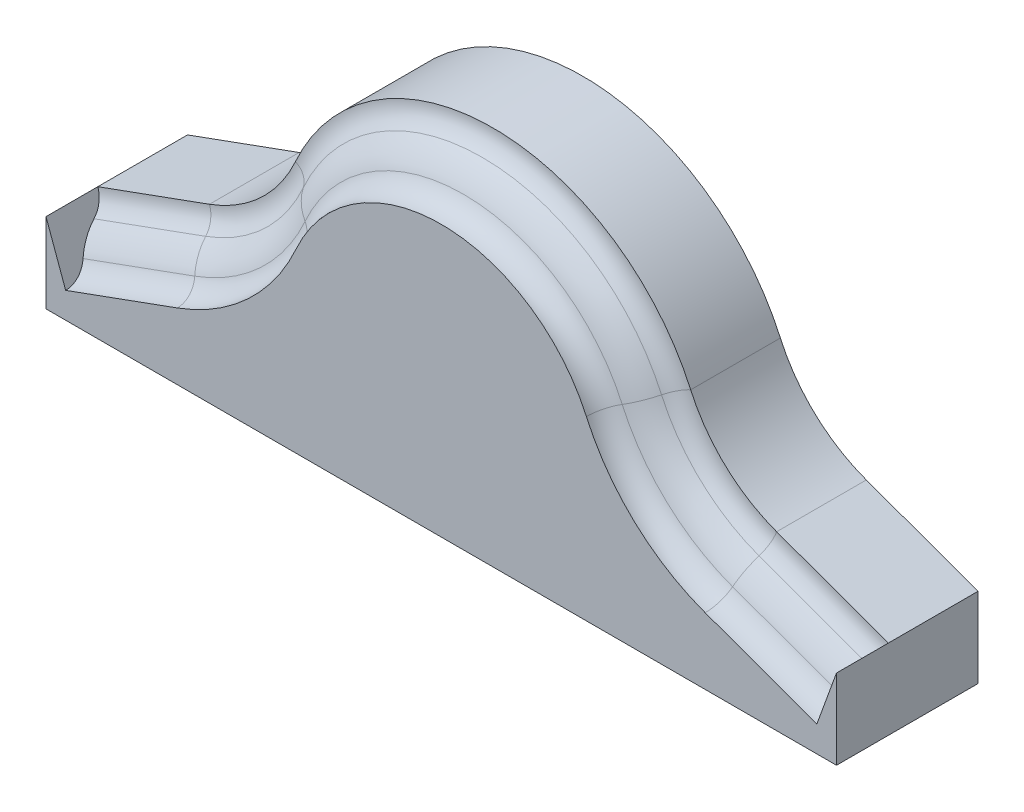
ISO-10303-21;
HEADER;
FILE_DESCRIPTION(('STEP AP214'),'2;1');
FILE_NAME('part.step','',(''),(''),'','','');
FILE_SCHEMA(('AUTOMOTIVE_DESIGN { 1 0 10303 214 1 1 1 1 }'));
ENDSEC;
DATA;
#1=APPLICATION_CONTEXT('core data for automotive mechanical design processes');
#2=APPLICATION_PROTOCOL_DEFINITION('international standard','automotive_design',2000,#1);
#3=PRODUCT_CONTEXT('',#1,'mechanical');
#4=PRODUCT('Part','Part','',(#3));
#5=PRODUCT_RELATED_PRODUCT_CATEGORY('part','',(#4));
#6=PRODUCT_DEFINITION_FORMATION('','',#4);
#7=PRODUCT_DEFINITION_CONTEXT('part definition',#1,'design');
#8=PRODUCT_DEFINITION('design','',#6,#7);
#9=PRODUCT_DEFINITION_SHAPE('','',#8);
#10=(LENGTH_UNIT() NAMED_UNIT(*) SI_UNIT(.MILLI.,.METRE.));
#11=(NAMED_UNIT(*) PLANE_ANGLE_UNIT() SI_UNIT($,.RADIAN.));
#12=(NAMED_UNIT(*) SI_UNIT($,.STERADIAN.) SOLID_ANGLE_UNIT());
#13=UNCERTAINTY_MEASURE_WITH_UNIT(LENGTH_MEASURE(1.E-05),#10,'distance_accuracy_value','');
#14=(GEOMETRIC_REPRESENTATION_CONTEXT(3) GLOBAL_UNCERTAINTY_ASSIGNED_CONTEXT((#13)) GLOBAL_UNIT_ASSIGNED_CONTEXT((#10,
#11,#12)) REPRESENTATION_CONTEXT('',''));
#15=CARTESIAN_POINT('',(0.,0.,0.));
#16=DIRECTION('',(0.,0.,1.));
#17=DIRECTION('',(1.,0.,0.));
#18=AXIS2_PLACEMENT_3D('',#15,#16,#17);
#19=CARTESIAN_POINT('',(118.091044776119,23.8835820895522,42.2753727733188));
#20=DIRECTION('',(-0.341743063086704,-0.939793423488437,0.));
#21=DIRECTION('',(0.939793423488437,-0.341743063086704,0.));
#22=AXIS2_PLACEMENT_3D('',#19,#20,#21);
#23=PLANE('',#22);
#24=DIRECTION('',(0.939793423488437,-0.341743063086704,0.));
#25=VECTOR('',#24,1.);
#26=CARTESIAN_POINT('',(84.7298507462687,36.0149253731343,26.7951819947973));
#27=LINE('',#26,#25);
#28=CARTESIAN_POINT('',(84.7298507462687,36.0149253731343,26.7951819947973));
#29=VERTEX_POINT('',#28);
#30=CARTESIAN_POINT('',(118.091044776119,23.8835820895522,26.7951819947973));
#31=VERTEX_POINT('',#30);
#32=EDGE_CURVE('E259',#29,#31,#27,.T.);
#33=ORIENTED_EDGE('',*,*,#32,.T.);
#34=DIRECTION('',(0.,0.,-1.));
#35=VECTOR('',#34,1.);
#36=CARTESIAN_POINT('',(118.091044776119,23.8835820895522,42.2753727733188));
#37=LINE('',#36,#35);
#38=CARTESIAN_POINT('',(118.091044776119,23.8835820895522,0.));
#39=VERTEX_POINT('',#38);
#40=EDGE_CURVE('E39',#31,#39,#37,.T.);
#41=ORIENTED_EDGE('',*,*,#40,.T.);
#42=DIRECTION('',(-0.939793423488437,0.341743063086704,0.));
#43=VECTOR('',#42,1.);
#44=CARTESIAN_POINT('',(118.091044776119,23.8835820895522,0.));
#45=LINE('',#44,#43);
#46=CARTESIAN_POINT('',(84.7298507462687,36.0149253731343,0.));
#47=VERTEX_POINT('',#46);
#48=EDGE_CURVE('E271',#39,#47,#45,.T.);
#49=ORIENTED_EDGE('',*,*,#48,.T.);
#50=DIRECTION('',(0.,0.,-1.));
#51=VECTOR('',#50,1.);
#52=CARTESIAN_POINT('',(84.7298507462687,36.0149253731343,42.2753727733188));
#53=LINE('',#52,#51);
#54=EDGE_CURVE('E307',#29,#47,#53,.T.);
#55=ORIENTED_EDGE('',*,*,#54,.F.);
#56=EDGE_LOOP('',(#33,#41,#49,#55));
#57=FACE_BOUND('',#56,.T.);
#58=ADVANCED_FACE('F31',(#57),#23,.F.);
#59=CARTESIAN_POINT('',(100.107949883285,78.3046979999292,42.2753727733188));
#60=DIRECTION('',(0.,0.,-1.));
#61=DIRECTION('',(-1.,0.,0.));
#62=AXIS2_PLACEMENT_3D('',#59,#60,#61);
#63=CYLINDRICAL_SURFACE('',#62,44.9990088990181);
#64=CARTESIAN_POINT('',(100.107949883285,78.3046979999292,26.7951819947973));
#65=DIRECTION('',(0.,0.,1.));
#66=DIRECTION('',(1.,0.,0.));
#67=AXIS2_PLACEMENT_3D('',#64,#65,#66);
#68=CIRCLE('',#67,44.9990088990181);
#69=CARTESIAN_POINT('',(59.0455223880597,59.8985074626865,26.7951819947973));
#70=VERTEX_POINT('',#69);
#71=EDGE_CURVE('E239',#70,#29,#68,.T.);
#72=ORIENTED_EDGE('',*,*,#71,.T.);
#73=ORIENTED_EDGE('',*,*,#54,.T.);
#74=CARTESIAN_POINT('',(100.107949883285,78.3046979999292,0.));
#75=DIRECTION('',(0.,0.,-1.));
#76=DIRECTION('',(-1.,0.,0.));
#77=AXIS2_PLACEMENT_3D('',#74,#75,#76);
#78=CIRCLE('',#77,44.9990088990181);
#79=CARTESIAN_POINT('',(59.0455223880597,59.8985074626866,0.));
#80=VERTEX_POINT('',#79);
#81=EDGE_CURVE('E274',#47,#80,#78,.T.);
#82=ORIENTED_EDGE('',*,*,#81,.T.);
#83=DIRECTION('',(0.,0.,-1.));
#84=VECTOR('',#83,1.);
#85=CARTESIAN_POINT('',(59.0455223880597,59.8985074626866,42.2753727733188));
#86=LINE('',#85,#84);
#87=EDGE_CURVE('E306',#70,#80,#86,.T.);
#88=ORIENTED_EDGE('',*,*,#87,.F.);
#89=EDGE_LOOP('',(#72,#73,#82,#88));
#90=FACE_BOUND('',#89,.T.);
#91=ADVANCED_FACE('F340',(#90),#63,.F.);
#92=CARTESIAN_POINT('',(0.,33.4314132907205,42.2753727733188));
#93=DIRECTION('',(0.,0.,-1.));
#94=DIRECTION('',(-1.,0.,0.));
#95=AXIS2_PLACEMENT_3D('',#92,#93,#94);
#96=CYLINDRICAL_SURFACE('',#95,64.7061109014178);
#97=CARTESIAN_POINT('',(0.,33.4314132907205,26.7951819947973));
#98=DIRECTION('',(0.,0.,-1.));
#99=DIRECTION('',(-1.,0.,0.));
#100=AXIS2_PLACEMENT_3D('',#97,#98,#99);
#101=CIRCLE('',#100,64.7061109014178);
#102=CARTESIAN_POINT('',(-59.0455223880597,59.8985074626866,26.7951819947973));
#103=VERTEX_POINT('',#102);
#104=EDGE_CURVE('E219',#103,#70,#101,.T.);
#105=ORIENTED_EDGE('',*,*,#104,.T.);
#106=ORIENTED_EDGE('',*,*,#87,.T.);
#107=CARTESIAN_POINT('',(0.,33.4314132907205,0.));
#108=DIRECTION('',(0.,0.,1.));
#109=DIRECTION('',(1.,0.,0.));
#110=AXIS2_PLACEMENT_3D('',#107,#108,#109);
#111=CIRCLE('',#110,64.7061109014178);
#112=CARTESIAN_POINT('',(-59.0455223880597,59.8985074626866,0.));
#113=VERTEX_POINT('',#112);
#114=EDGE_CURVE('E277',#80,#113,#111,.T.);
#115=ORIENTED_EDGE('',*,*,#114,.T.);
#116=DIRECTION('',(0.,0.,-1.));
#117=VECTOR('',#116,1.);
#118=CARTESIAN_POINT('',(-59.0455223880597,59.8985074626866,42.2753727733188));
#119=LINE('',#118,#117);
#120=EDGE_CURVE('E304',#103,#113,#119,.T.);
#121=ORIENTED_EDGE('',*,*,#120,.F.);
#122=EDGE_LOOP('',(#105,#106,#115,#121));
#123=FACE_BOUND('',#122,.T.);
#124=ADVANCED_FACE('F338',(#123),#96,.T.);
#125=CARTESIAN_POINT('',(-100.107949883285,78.3046979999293,42.2753727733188));
#126=DIRECTION('',(0.,0.,-1.));
#127=DIRECTION('',(-1.,0.,0.));
#128=AXIS2_PLACEMENT_3D('',#125,#126,#127);
#129=CYLINDRICAL_SURFACE('',#128,44.9990088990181);
#130=CARTESIAN_POINT('',(-100.107949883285,78.3046979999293,26.7951819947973));
#131=DIRECTION('',(0.,0.,1.));
#132=DIRECTION('',(1.,0.,0.));
#133=AXIS2_PLACEMENT_3D('',#130,#131,#132);
#134=CIRCLE('',#133,44.9990088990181);
#135=CARTESIAN_POINT('',(-84.7298507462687,36.0149253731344,26.7951819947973));
#136=VERTEX_POINT('',#135);
#137=EDGE_CURVE('E199',#136,#103,#134,.T.);
#138=ORIENTED_EDGE('',*,*,#137,.T.);
#139=ORIENTED_EDGE('',*,*,#120,.T.);
#140=CARTESIAN_POINT('',(-100.107949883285,78.3046979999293,0.));
#141=DIRECTION('',(0.,0.,-1.));
#142=DIRECTION('',(1.,0.,0.));
#143=AXIS2_PLACEMENT_3D('',#140,#141,#142);
#144=CIRCLE('',#143,44.9990088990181);
#145=CARTESIAN_POINT('',(-84.7298507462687,36.0149253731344,0.));
#146=VERTEX_POINT('',#145);
#147=EDGE_CURVE('E280',#113,#146,#144,.T.);
#148=ORIENTED_EDGE('',*,*,#147,.T.);
#149=DIRECTION('',(0.,0.,-1.));
#150=VECTOR('',#149,1.);
#151=CARTESIAN_POINT('',(-84.7298507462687,36.0149253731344,42.2753727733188));
#152=LINE('',#151,#150);
#153=EDGE_CURVE('E302',#136,#146,#152,.T.);
#154=ORIENTED_EDGE('',*,*,#153,.F.);
#155=EDGE_LOOP('',(#138,#139,#148,#154));
#156=FACE_BOUND('',#155,.T.);
#157=ADVANCED_FACE('F335',(#156),#129,.F.);
#158=CARTESIAN_POINT('',(118.091044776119,0.,42.2753727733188));
#159=DIRECTION('',(-1.,0.,0.));
#160=DIRECTION('',(0.,0.,1.));
#161=AXIS2_PLACEMENT_3D('',#158,#159,#160);
#162=PLANE('',#161);
#163=DIRECTION('',(0.,1.,0.));
#164=VECTOR('',#163,1.);
#165=CARTESIAN_POINT('',(118.091044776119,0.,0.));
#166=LINE('',#165,#164);
#167=CARTESIAN_POINT('',(118.091044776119,0.,0.));
#168=VERTEX_POINT('',#167);
#169=EDGE_CURVE('E268',#168,#39,#166,.T.);
#170=ORIENTED_EDGE('',*,*,#169,.T.);
#171=ORIENTED_EDGE('',*,*,#40,.F.);
#172=CARTESIAN_POINT('',(118.091044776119,23.8835820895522,42.2753727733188));
#173=VERTEX_POINT('',#172);
#174=EDGE_CURVE('E11',#173,#31,#37,.T.);
#175=ORIENTED_EDGE('',*,*,#174,.F.);
#176=DIRECTION('',(0.,1.,0.));
#177=VECTOR('',#176,1.);
#178=CARTESIAN_POINT('',(118.091044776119,0.,42.2753727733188));
#179=LINE('',#178,#177);
#180=CARTESIAN_POINT('',(118.091044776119,0.,42.2753727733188));
#181=VERTEX_POINT('',#180);
#182=EDGE_CURVE('E290',#181,#173,#179,.T.);
#183=ORIENTED_EDGE('',*,*,#182,.F.);
#184=DIRECTION('',(0.,0.,-1.));
#185=VECTOR('',#184,1.);
#186=CARTESIAN_POINT('',(118.091044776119,0.,42.2753727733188));
#187=LINE('',#186,#185);
#188=EDGE_CURVE('E294',#181,#168,#187,.T.);
#189=ORIENTED_EDGE('',*,*,#188,.T.);
#190=EDGE_LOOP('',(#170,#171,#175,#183,#189));
#191=FACE_BOUND('',#190,.T.);
#192=ADVANCED_FACE('F33',(#191),#162,.F.);
#193=CARTESIAN_POINT('',(-118.091044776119,23.8835820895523,42.2753727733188));
#194=DIRECTION('',(0.341743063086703,-0.939793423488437,0.));
#195=DIRECTION('',(0.939793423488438,0.341743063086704,0.));
#196=AXIS2_PLACEMENT_3D('',#193,#194,#195);
#197=PLANE('',#196);
#198=DIRECTION('',(0.,0.,-1.));
#199=VECTOR('',#198,1.);
#200=CARTESIAN_POINT('',(-118.091044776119,23.8835820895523,42.2753727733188));
#201=LINE('',#200,#199);
#202=CARTESIAN_POINT('',(-118.091044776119,23.8835820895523,26.7951819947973));
#203=VERTEX_POINT('',#202);
#204=CARTESIAN_POINT('',(-118.091044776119,23.8835820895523,0.));
#205=VERTEX_POINT('',#204);
#206=EDGE_CURVE('E300',#203,#205,#201,.T.);
#207=ORIENTED_EDGE('',*,*,#206,.F.);
#208=DIRECTION('',(-0.939793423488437,-0.341743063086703,0.));
#209=VECTOR('',#208,1.);
#210=CARTESIAN_POINT('',(-84.7298507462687,36.0149253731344,26.7951819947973));
#211=LINE('',#210,#209);
#212=EDGE_CURVE('E180',#136,#203,#211,.T.);
#213=ORIENTED_EDGE('',*,*,#212,.F.);
#214=ORIENTED_EDGE('',*,*,#153,.T.);
#215=DIRECTION('',(-0.939793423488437,-0.341743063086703,0.));
#216=VECTOR('',#215,1.);
#217=CARTESIAN_POINT('',(-118.091044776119,23.8835820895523,0.));
#218=LINE('',#217,#216);
#219=EDGE_CURVE('E283',#146,#205,#218,.T.);
#220=ORIENTED_EDGE('',*,*,#219,.T.);
#221=EDGE_LOOP('',(#207,#213,#214,#220));
#222=FACE_BOUND('',#221,.T.);
#223=ADVANCED_FACE('F332',(#222),#197,.F.);
#224=CARTESIAN_POINT('',(-118.091044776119,0.,42.2753727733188));
#225=DIRECTION('',(1.,0.,0.));
#226=DIRECTION('',(0.,0.,-1.));
#227=AXIS2_PLACEMENT_3D('',#224,#225,#226);
#228=PLANE('',#227);
#229=DIRECTION('',(0.,-1.,0.));
#230=VECTOR('',#229,1.);
#231=CARTESIAN_POINT('',(-118.091044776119,0.,0.));
#232=LINE('',#231,#230);
#233=CARTESIAN_POINT('',(-118.091044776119,0.,0.));
#234=VERTEX_POINT('',#233);
#235=EDGE_CURVE('E286',#205,#234,#232,.T.);
#236=ORIENTED_EDGE('',*,*,#235,.T.);
#237=DIRECTION('',(0.,0.,-1.));
#238=VECTOR('',#237,1.);
#239=CARTESIAN_POINT('',(-118.091044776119,0.,42.2753727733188));
#240=LINE('',#239,#238);
#241=CARTESIAN_POINT('',(-118.091044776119,0.,42.2753727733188));
#242=VERTEX_POINT('',#241);
#243=EDGE_CURVE('E297',#242,#234,#240,.T.);
#244=ORIENTED_EDGE('',*,*,#243,.F.);
#245=DIRECTION('',(0.,-1.,0.));
#246=VECTOR('',#245,1.);
#247=CARTESIAN_POINT('',(-118.091044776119,0.,42.2753727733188));
#248=LINE('',#247,#246);
#249=CARTESIAN_POINT('',(-118.091044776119,23.8835820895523,42.2753727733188));
#250=VERTEX_POINT('',#249);
#251=EDGE_CURVE('E51',#250,#242,#248,.T.);
#252=ORIENTED_EDGE('',*,*,#251,.F.);
#253=EDGE_CURVE('E163',#250,#203,#201,.T.);
#254=ORIENTED_EDGE('',*,*,#253,.T.);
#255=ORIENTED_EDGE('',*,*,#206,.T.);
#256=EDGE_LOOP('',(#236,#244,#252,#254,#255));
#257=FACE_BOUND('',#256,.T.);
#258=ADVANCED_FACE('F328',(#257),#228,.F.);
#259=CARTESIAN_POINT('',(-118.091044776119,0.,42.2753727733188));
#260=DIRECTION('',(0.,1.,0.));
#261=DIRECTION('',(-1.,0.,0.));
#262=AXIS2_PLACEMENT_3D('',#259,#260,#261);
#263=PLANE('',#262);
#264=DIRECTION('',(1.,0.,0.));
#265=VECTOR('',#264,1.);
#266=CARTESIAN_POINT('',(-118.091044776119,0.,0.));
#267=LINE('',#266,#265);
#268=EDGE_CURVE('E288',#234,#168,#267,.T.);
#269=ORIENTED_EDGE('',*,*,#268,.T.);
#270=ORIENTED_EDGE('',*,*,#188,.F.);
#271=DIRECTION('',(1.,0.,0.));
#272=VECTOR('',#271,1.);
#273=CARTESIAN_POINT('',(-118.091044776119,0.,42.2753727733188));
#274=LINE('',#273,#272);
#275=EDGE_CURVE('E46',#242,#181,#274,.T.);
#276=ORIENTED_EDGE('',*,*,#275,.F.);
#277=ORIENTED_EDGE('',*,*,#243,.T.);
#278=EDGE_LOOP('',(#269,#270,#276,#277));
#279=FACE_BOUND('',#278,.T.);
#280=ADVANCED_FACE('F323',(#279),#263,.F.);
#281=CARTESIAN_POINT('',(100.107949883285,78.3046979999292,42.2753727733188));
#282=DIRECTION('',(0.,0.,-1.));
#283=DIRECTION('',(-1.,0.,0.));
#284=AXIS2_PLACEMENT_3D('',#281,#282,#283);
#285=PLANE('',#284);
#286=ORIENTED_EDGE('',*,*,#182,.T.);
#287=DIRECTION('',(0.341743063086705,0.939793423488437,0.));
#288=VECTOR('',#287,1.);
#289=CARTESIAN_POINT('',(112.217196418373,7.73049910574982,42.2753727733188));
#290=LINE('',#289,#288);
#291=CARTESIAN_POINT('',(112.217196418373,7.73049910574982,42.2753727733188));
#292=VERTEX_POINT('',#291);
#293=EDGE_CURVE('E250',#292,#173,#290,.T.);
#294=ORIENTED_EDGE('',*,*,#293,.F.);
#295=DIRECTION('',(0.939793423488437,-0.341743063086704,0.));
#296=VECTOR('',#295,1.);
#297=CARTESIAN_POINT('',(78.8560023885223,19.8618423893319,42.2753727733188));
#298=LINE('',#297,#296);
#299=CARTESIAN_POINT('',(78.8560023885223,19.8618423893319,42.2753727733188));
#300=VERTEX_POINT('',#299);
#301=EDGE_CURVE('E256',#300,#292,#298,.T.);
#302=ORIENTED_EDGE('',*,*,#301,.F.);
#303=CARTESIAN_POINT('',(100.107949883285,78.3046979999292,42.2753727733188));
#304=DIRECTION('',(0.,0.,1.));
#305=DIRECTION('',(1.,0.,0.));
#306=AXIS2_PLACEMENT_3D('',#303,#304,#305);
#307=CIRCLE('',#306,62.1869169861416);
#308=CARTESIAN_POINT('',(43.3612385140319,52.868043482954,42.2753727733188));
#309=VERTEX_POINT('',#308);
#310=EDGE_CURVE('E236',#309,#300,#307,.T.);
#311=ORIENTED_EDGE('',*,*,#310,.F.);
#312=CARTESIAN_POINT('',(0.,33.4314132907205,42.2753727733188));
#313=DIRECTION('',(0.,0.,-1.));
#314=DIRECTION('',(-1.,0.,0.));
#315=AXIS2_PLACEMENT_3D('',#312,#313,#314);
#316=CIRCLE('',#315,47.5182028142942);
#317=CARTESIAN_POINT('',(-43.3612385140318,52.8680434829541,42.2753727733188));
#318=VERTEX_POINT('',#317);
#319=EDGE_CURVE('E216',#318,#309,#316,.T.);
#320=ORIENTED_EDGE('',*,*,#319,.F.);
#321=CARTESIAN_POINT('',(-100.107949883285,78.3046979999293,42.2753727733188));
#322=DIRECTION('',(0.,0.,1.));
#323=DIRECTION('',(1.,0.,0.));
#324=AXIS2_PLACEMENT_3D('',#321,#322,#323);
#325=CIRCLE('',#324,62.1869169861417);
#326=CARTESIAN_POINT('',(-78.8560023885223,19.8618423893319,42.2753727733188));
#327=VERTEX_POINT('',#326);
#328=EDGE_CURVE('E179',#327,#318,#325,.T.);
#329=ORIENTED_EDGE('',*,*,#328,.F.);
#330=DIRECTION('',(-0.939793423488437,-0.341743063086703,0.));
#331=VECTOR('',#330,1.);
#332=CARTESIAN_POINT('',(-78.8560023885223,19.8618423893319,42.2753727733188));
#333=LINE('',#332,#331);
#334=CARTESIAN_POINT('',(-112.217196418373,7.73049910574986,42.2753727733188));
#335=VERTEX_POINT('',#334);
#336=EDGE_CURVE('E170',#327,#335,#333,.T.);
#337=ORIENTED_EDGE('',*,*,#336,.T.);
#338=DIRECTION('',(-0.341743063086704,0.939793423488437,0.));
#339=VECTOR('',#338,1.);
#340=CARTESIAN_POINT('',(-112.217196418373,7.73049910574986,42.2753727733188));
#341=LINE('',#340,#339);
#342=EDGE_CURVE('E155',#335,#250,#341,.T.);
#343=ORIENTED_EDGE('',*,*,#342,.T.);
#344=ORIENTED_EDGE('',*,*,#251,.T.);
#345=ORIENTED_EDGE('',*,*,#275,.T.);
#346=EDGE_LOOP('',(#286,#294,#302,#311,#320,#329,#337,#343,#344,#345));
#347=FACE_BOUND('',#346,.T.);
#348=ADVANCED_FACE('F176',(#347),#285,.F.);
#349=CARTESIAN_POINT('',(100.107949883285,78.3046979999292,0.));
#350=DIRECTION('',(0.,0.,-1.));
#351=DIRECTION('',(-1.,0.,0.));
#352=AXIS2_PLACEMENT_3D('',#349,#350,#351);
#353=PLANE('',#352);
#354=ORIENTED_EDGE('',*,*,#169,.F.);
#355=ORIENTED_EDGE('',*,*,#268,.F.);
#356=ORIENTED_EDGE('',*,*,#235,.F.);
#357=ORIENTED_EDGE('',*,*,#219,.F.);
#358=ORIENTED_EDGE('',*,*,#147,.F.);
#359=ORIENTED_EDGE('',*,*,#114,.F.);
#360=ORIENTED_EDGE('',*,*,#81,.F.);
#361=ORIENTED_EDGE('',*,*,#48,.F.);
#362=EDGE_LOOP('',(#354,#355,#356,#357,#358,#359,#360,#361));
#363=FACE_BOUND('',#362,.T.);
#364=ADVANCED_FACE('F318',(#363),#353,.T.);
#365=CARTESIAN_POINT('',(78.2350729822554,18.1542865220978,21.1927736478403));
#366=DIRECTION('',(0.939793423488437,-0.341743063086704,0.));
#367=DIRECTION('',(0.341743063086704,0.939793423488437,0.));
#368=AXIS2_PLACEMENT_3D('',#365,#366,#367);
#369=CYLINDRICAL_SURFACE('',#368,15.6743680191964);
#370=CARTESIAN_POINT('',(78.2350729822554,18.1542865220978,21.1927736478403));
#371=DIRECTION('',(0.939793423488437,-0.341743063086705,0.));
#372=DIRECTION('',(-0.341743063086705,-0.939793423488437,0.));
#373=AXIS2_PLACEMENT_3D('',#370,#371,#372);
#374=CIRCLE('',#373,15.6743680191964);
#375=CARTESIAN_POINT('',(82.6677442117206,30.344132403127,29.9930518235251));
#376=VERTEX_POINT('',#375);
#377=CARTESIAN_POINT('',(80.3595905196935,23.9967097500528,35.5816001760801));
#378=VERTEX_POINT('',#377);
#379=EDGE_CURVE('E233',#376,#378,#374,.T.);
#380=ORIENTED_EDGE('',*,*,#379,.T.);
#381=DIRECTION('',(0.939793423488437,-0.341743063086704,0.));
#382=VECTOR('',#381,1.);
#383=CARTESIAN_POINT('',(80.3595905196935,23.9967097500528,35.5816001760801));
#384=LINE('',#383,#382);
#385=CARTESIAN_POINT('',(113.720784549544,11.8653664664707,35.5816001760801));
#386=VERTEX_POINT('',#385);
#387=EDGE_CURVE('E265',#378,#386,#384,.T.);
#388=ORIENTED_EDGE('',*,*,#387,.T.);
#389=CARTESIAN_POINT('',(111.596267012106,6.02294323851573,21.1927736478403));
#390=DIRECTION('',(0.939793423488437,-0.341743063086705,0.));
#391=DIRECTION('',(-0.341743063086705,-0.939793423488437,0.));
#392=AXIS2_PLACEMENT_3D('',#389,#390,#391);
#393=CIRCLE('',#392,15.6743680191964);
#394=CARTESIAN_POINT('',(116.028938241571,18.2127891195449,29.9930518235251));
#395=VERTEX_POINT('',#394);
#396=EDGE_CURVE('E254',#395,#386,#393,.T.);
#397=ORIENTED_EDGE('',*,*,#396,.F.);
#398=DIRECTION('',(0.939793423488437,-0.341743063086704,0.));
#399=VECTOR('',#398,1.);
#400=CARTESIAN_POINT('',(82.6677442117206,30.344132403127,29.9930518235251));
#401=LINE('',#400,#399);
#402=EDGE_CURVE('E262',#376,#395,#401,.T.);
#403=ORIENTED_EDGE('',*,*,#402,.F.);
#404=EDGE_LOOP('',(#380,#388,#397,#403));
#405=FACE_BOUND('',#404,.T.);
#406=ADVANCED_FACE('F361',(#405),#369,.T.);
#407=CARTESIAN_POINT('',(84.7298507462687,36.0149253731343,34.0869965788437));
#408=DIRECTION('',(0.939793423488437,-0.341743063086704,0.));
#409=DIRECTION('',(0.341743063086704,0.939793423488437,0.));
#410=AXIS2_PLACEMENT_3D('',#407,#408,#409);
#411=CYLINDRICAL_SURFACE('',#410,7.29181458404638);
#412=CARTESIAN_POINT('',(84.7298507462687,36.0149253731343,34.0869965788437));
#413=DIRECTION('',(-0.939793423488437,0.341743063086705,0.));
#414=DIRECTION('',(-0.341743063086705,-0.939793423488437,0.));
#415=AXIS2_PLACEMENT_3D('',#412,#413,#414);
#416=CIRCLE('',#415,7.29181458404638);
#417=EDGE_CURVE('E230',#29,#376,#416,.T.);
#418=ORIENTED_EDGE('',*,*,#417,.T.);
#419=ORIENTED_EDGE('',*,*,#402,.T.);
#420=CARTESIAN_POINT('',(118.091044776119,23.8835820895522,34.0869965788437));
#421=DIRECTION('',(-0.939793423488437,0.341743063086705,0.));
#422=DIRECTION('',(-0.341743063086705,-0.939793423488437,0.));
#423=AXIS2_PLACEMENT_3D('',#420,#421,#422);
#424=CIRCLE('',#423,7.29181458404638);
#425=EDGE_CURVE('E252',#31,#395,#424,.T.);
#426=ORIENTED_EDGE('',*,*,#425,.F.);
#427=ORIENTED_EDGE('',*,*,#32,.F.);
#428=EDGE_LOOP('',(#418,#419,#426,#427));
#429=FACE_BOUND('',#428,.T.);
#430=ADVANCED_FACE('F364',(#429),#411,.F.);
#431=CARTESIAN_POINT('',(81.3479294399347,26.7146417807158,42.2753727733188));
#432=DIRECTION('',(0.939793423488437,-0.341743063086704,0.));
#433=DIRECTION('',(0.341743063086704,0.939793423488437,0.));
#434=AXIS2_PLACEMENT_3D('',#431,#432,#433);
#435=CYLINDRICAL_SURFACE('',#434,7.29181458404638);
#436=CARTESIAN_POINT('',(81.3479294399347,26.7146417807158,42.2753727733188));
#437=DIRECTION('',(-0.939793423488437,0.341743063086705,0.));
#438=DIRECTION('',(0.341743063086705,0.939793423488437,0.));
#439=AXIS2_PLACEMENT_3D('',#436,#437,#438);
#440=CIRCLE('',#439,7.29181458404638);
#441=EDGE_CURVE('E228',#378,#300,#440,.T.);
#442=ORIENTED_EDGE('',*,*,#441,.T.);
#443=ORIENTED_EDGE('',*,*,#301,.T.);
#444=CARTESIAN_POINT('',(114.709123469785,14.5832984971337,42.2753727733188));
#445=DIRECTION('',(-0.939793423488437,0.341743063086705,0.));
#446=DIRECTION('',(0.341743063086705,0.939793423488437,0.));
#447=AXIS2_PLACEMENT_3D('',#444,#445,#446);
#448=CIRCLE('',#447,7.29181458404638);
#449=EDGE_CURVE('E248',#386,#292,#448,.T.);
#450=ORIENTED_EDGE('',*,*,#449,.F.);
#451=ORIENTED_EDGE('',*,*,#387,.F.);
#452=EDGE_LOOP('',(#442,#443,#450,#451));
#453=FACE_BOUND('',#452,.T.);
#454=ADVANCED_FACE('F368',(#453),#435,.F.);
#455=CARTESIAN_POINT('',(100.107949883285,78.3046979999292,21.1927736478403));
#456=DIRECTION('',(0.,0.,1.));
#457=DIRECTION('',(1.,0.,0.));
#458=AXIS2_PLACEMENT_3D('',#455,#456,#457);
#459=TOROIDAL_SURFACE('',#458,64.0038650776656,15.6743680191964);
#460=CARTESIAN_POINT('',(41.7032397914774,52.124847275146,21.1927736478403));
#461=DIRECTION('',(0.409035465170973,-0.912518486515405,0.));
#462=DIRECTION('',(-0.912518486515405,-0.409035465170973,0.));
#463=AXIS2_PLACEMENT_3D('',#460,#461,#462);
#464=CIRCLE('',#463,15.6743680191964);
#465=CARTESIAN_POINT('',(53.5393086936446,57.4303528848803,29.9930518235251));
#466=VERTEX_POINT('',#465);
#467=CARTESIAN_POINT('',(47.3761026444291,54.6677021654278,35.5816001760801));
#468=VERTEX_POINT('',#467);
#469=EDGE_CURVE('E213',#466,#468,#464,.T.);
#470=ORIENTED_EDGE('',*,*,#469,.T.);
#471=CARTESIAN_POINT('',(100.107949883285,78.3046979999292,35.5816001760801));
#472=DIRECTION('',(0.,0.,1.));
#473=DIRECTION('',(1.,0.,0.));
#474=AXIS2_PLACEMENT_3D('',#471,#472,#473);
#475=CIRCLE('',#474,57.7871550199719);
#476=EDGE_CURVE('E245',#468,#378,#475,.T.);
#477=ORIENTED_EDGE('',*,*,#476,.T.);
#478=ORIENTED_EDGE('',*,*,#379,.F.);
#479=CARTESIAN_POINT('',(100.107949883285,78.3046979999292,29.9930518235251));
#480=DIRECTION('',(0.,0.,1.));
#481=DIRECTION('',(1.,0.,0.));
#482=AXIS2_PLACEMENT_3D('',#479,#480,#481);
#483=CIRCLE('',#482,51.033093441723);
#484=EDGE_CURVE('E242',#466,#376,#483,.T.);
#485=ORIENTED_EDGE('',*,*,#484,.F.);
#486=EDGE_LOOP('',(#470,#477,#478,#485));
#487=FACE_BOUND('',#486,.T.);
#488=ADVANCED_FACE('F372',(#487),#459,.T.);
#489=CARTESIAN_POINT('',(100.107949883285,78.3046979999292,34.0869965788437));
#490=DIRECTION('',(0.,0.,1.));
#491=DIRECTION('',(1.,0.,0.));
#492=AXIS2_PLACEMENT_3D('',#489,#490,#491);
#493=TOROIDAL_SURFACE('',#492,44.9990088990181,7.29181458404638);
#494=CARTESIAN_POINT('',(59.0455223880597,59.8985074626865,34.0869965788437));
#495=DIRECTION('',(-0.409035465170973,0.912518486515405,0.));
#496=DIRECTION('',(-0.912518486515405,-0.409035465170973,0.));
#497=AXIS2_PLACEMENT_3D('',#494,#495,#496);
#498=CIRCLE('',#497,7.29181458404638);
#499=EDGE_CURVE('E210',#70,#466,#498,.T.);
#500=ORIENTED_EDGE('',*,*,#499,.T.);
#501=ORIENTED_EDGE('',*,*,#484,.T.);
#502=ORIENTED_EDGE('',*,*,#417,.F.);
#503=ORIENTED_EDGE('',*,*,#71,.F.);
#504=EDGE_LOOP('',(#500,#501,#502,#503));
#505=FACE_BOUND('',#504,.T.);
#506=ADVANCED_FACE('F376',(#505),#493,.F.);
#507=CARTESIAN_POINT('',(100.107949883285,78.3046979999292,42.2753727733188));
#508=DIRECTION('',(0.,0.,1.));
#509=DIRECTION('',(1.,0.,0.));
#510=AXIS2_PLACEMENT_3D('',#507,#508,#509);
#511=TOROIDAL_SURFACE('',#510,54.8951024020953,7.29181458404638);
#512=CARTESIAN_POINT('',(50.0151541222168,55.8506542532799,42.2753727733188));
#513=DIRECTION('',(-0.409035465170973,0.912518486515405,0.));
#514=DIRECTION('',(0.912518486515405,0.409035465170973,0.));
#515=AXIS2_PLACEMENT_3D('',#512,#513,#514);
#516=CIRCLE('',#515,7.29181458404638);
#517=EDGE_CURVE('E208',#468,#309,#516,.T.);
#518=ORIENTED_EDGE('',*,*,#517,.T.);
#519=ORIENTED_EDGE('',*,*,#310,.T.);
#520=ORIENTED_EDGE('',*,*,#441,.F.);
#521=ORIENTED_EDGE('',*,*,#476,.F.);
#522=EDGE_LOOP('',(#518,#519,#520,#521));
#523=FACE_BOUND('',#522,.T.);
#524=ADVANCED_FACE('F380',(#523),#511,.F.);
#525=CARTESIAN_POINT('',(0.,33.4314132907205,21.1927736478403));
#526=DIRECTION('',(0.,0.,-1.));
#527=DIRECTION('',(-1.,0.,0.));
#528=AXIS2_PLACEMENT_3D('',#525,#526,#527);
#529=TOROIDAL_SURFACE('',#528,45.7012547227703,15.6743680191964);
#530=CARTESIAN_POINT('',(-41.7032397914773,52.124847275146,21.1927736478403));
#531=DIRECTION('',(0.409035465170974,0.912518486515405,0.));
#532=DIRECTION('',(0.912518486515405,-0.409035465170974,0.));
#533=AXIS2_PLACEMENT_3D('',#530,#531,#532);
#534=CIRCLE('',#533,15.6743680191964);
#535=CARTESIAN_POINT('',(-53.5393086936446,57.4303528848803,29.9930518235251));
#536=VERTEX_POINT('',#535);
#537=CARTESIAN_POINT('',(-47.3761026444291,54.6677021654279,35.5816001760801));
#538=VERTEX_POINT('',#537);
#539=EDGE_CURVE('E195',#536,#538,#534,.T.);
#540=ORIENTED_EDGE('',*,*,#539,.T.);
#541=CARTESIAN_POINT('',(0.,33.4314132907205,35.5816001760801));
#542=DIRECTION('',(0.,0.,-1.));
#543=DIRECTION('',(-1.,0.,0.));
#544=AXIS2_PLACEMENT_3D('',#541,#542,#543);
#545=CIRCLE('',#544,51.917964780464);
#546=EDGE_CURVE('E225',#538,#468,#545,.T.);
#547=ORIENTED_EDGE('',*,*,#546,.T.);
#548=ORIENTED_EDGE('',*,*,#469,.F.);
#549=CARTESIAN_POINT('',(0.,33.4314132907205,29.9930518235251));
#550=DIRECTION('',(0.,0.,-1.));
#551=DIRECTION('',(-1.,0.,0.));
#552=AXIS2_PLACEMENT_3D('',#549,#550,#551);
#553=CIRCLE('',#552,58.6720263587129);
#554=EDGE_CURVE('E222',#536,#466,#553,.T.);
#555=ORIENTED_EDGE('',*,*,#554,.F.);
#556=EDGE_LOOP('',(#540,#547,#548,#555));
#557=FACE_BOUND('',#556,.T.);
#558=ADVANCED_FACE('F384',(#557),#529,.T.);
#559=CARTESIAN_POINT('',(0.,33.4314132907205,34.0869965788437));
#560=DIRECTION('',(0.,0.,-1.));
#561=DIRECTION('',(-1.,0.,0.));
#562=AXIS2_PLACEMENT_3D('',#559,#560,#561);
#563=TOROIDAL_SURFACE('',#562,64.7061109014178,7.29181458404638);
#564=CARTESIAN_POINT('',(-59.0455223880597,59.8985074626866,34.0869965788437));
#565=DIRECTION('',(-0.409035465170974,-0.912518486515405,0.));
#566=DIRECTION('',(0.912518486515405,-0.409035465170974,0.));
#567=AXIS2_PLACEMENT_3D('',#564,#565,#566);
#568=CIRCLE('',#567,7.29181458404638);
#569=EDGE_CURVE('E192',#103,#536,#568,.T.);
#570=ORIENTED_EDGE('',*,*,#569,.T.);
#571=ORIENTED_EDGE('',*,*,#554,.T.);
#572=ORIENTED_EDGE('',*,*,#499,.F.);
#573=ORIENTED_EDGE('',*,*,#104,.F.);
#574=EDGE_LOOP('',(#570,#571,#572,#573));
#575=FACE_BOUND('',#574,.T.);
#576=ADVANCED_FACE('F388',(#575),#563,.F.);
#577=CARTESIAN_POINT('',(0.,33.4314132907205,42.2753727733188));
#578=DIRECTION('',(0.,0.,-1.));
#579=DIRECTION('',(-1.,0.,0.));
#580=AXIS2_PLACEMENT_3D('',#577,#578,#579);
#581=TOROIDAL_SURFACE('',#580,54.8100173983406,7.29181458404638);
#582=CARTESIAN_POINT('',(-50.0151541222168,55.85065425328,42.2753727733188));
#583=DIRECTION('',(-0.409035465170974,-0.912518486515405,0.));
#584=DIRECTION('',(-0.912518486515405,0.409035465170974,0.));
#585=AXIS2_PLACEMENT_3D('',#582,#583,#584);
#586=CIRCLE('',#585,7.29181458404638);
#587=EDGE_CURVE('E190',#538,#318,#586,.T.);
#588=ORIENTED_EDGE('',*,*,#587,.T.);
#589=ORIENTED_EDGE('',*,*,#319,.T.);
#590=ORIENTED_EDGE('',*,*,#517,.F.);
#591=ORIENTED_EDGE('',*,*,#546,.F.);
#592=EDGE_LOOP('',(#588,#589,#590,#591));
#593=FACE_BOUND('',#592,.T.);
#594=ADVANCED_FACE('F392',(#593),#581,.F.);
#595=CARTESIAN_POINT('',(-100.107949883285,78.3046979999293,21.1927736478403));
#596=DIRECTION('',(0.,0.,1.));
#597=DIRECTION('',(1.,0.,0.));
#598=AXIS2_PLACEMENT_3D('',#595,#596,#597);
#599=TOROIDAL_SURFACE('',#598,64.0038650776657,15.6743680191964);
#600=CARTESIAN_POINT('',(-78.2350729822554,18.1542865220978,21.1927736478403));
#601=DIRECTION('',(0.939793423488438,0.341743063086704,0.));
#602=DIRECTION('',(0.341743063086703,-0.939793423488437,0.));
#603=AXIS2_PLACEMENT_3D('',#600,#601,#602);
#604=CIRCLE('',#603,15.6743680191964);
#605=CARTESIAN_POINT('',(-82.6677442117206,30.344132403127,29.9930518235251));
#606=VERTEX_POINT('',#605);
#607=CARTESIAN_POINT('',(-80.3595905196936,23.9967097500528,35.5816001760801));
#608=VERTEX_POINT('',#607);
#609=EDGE_CURVE('E181',#606,#608,#604,.T.);
#610=ORIENTED_EDGE('',*,*,#609,.T.);
#611=CARTESIAN_POINT('',(-100.107949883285,78.3046979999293,35.5816001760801));
#612=DIRECTION('',(0.,0.,1.));
#613=DIRECTION('',(1.,0.,0.));
#614=AXIS2_PLACEMENT_3D('',#611,#612,#613);
#615=CIRCLE('',#614,57.7871550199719);
#616=EDGE_CURVE('E205',#608,#538,#615,.T.);
#617=ORIENTED_EDGE('',*,*,#616,.T.);
#618=ORIENTED_EDGE('',*,*,#539,.F.);
#619=CARTESIAN_POINT('',(-100.107949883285,78.3046979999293,29.9930518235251));
#620=DIRECTION('',(0.,0.,1.));
#621=DIRECTION('',(1.,0.,0.));
#622=AXIS2_PLACEMENT_3D('',#619,#620,#621);
#623=CIRCLE('',#622,51.033093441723);
#624=EDGE_CURVE('E202',#606,#536,#623,.T.);
#625=ORIENTED_EDGE('',*,*,#624,.F.);
#626=EDGE_LOOP('',(#610,#617,#618,#625));
#627=FACE_BOUND('',#626,.T.);
#628=ADVANCED_FACE('F396',(#627),#599,.T.);
#629=CARTESIAN_POINT('',(-100.107949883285,78.3046979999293,34.0869965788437));
#630=DIRECTION('',(0.,0.,1.));
#631=DIRECTION('',(1.,0.,0.));
#632=AXIS2_PLACEMENT_3D('',#629,#630,#631);
#633=TOROIDAL_SURFACE('',#632,44.9990088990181,7.29181458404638);
#634=CARTESIAN_POINT('',(-84.7298507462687,36.0149253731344,34.0869965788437));
#635=DIRECTION('',(-0.939793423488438,-0.341743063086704,0.));
#636=DIRECTION('',(0.341743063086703,-0.939793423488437,0.));
#637=AXIS2_PLACEMENT_3D('',#634,#635,#636);
#638=CIRCLE('',#637,7.29181458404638);
#639=EDGE_CURVE('E186',#136,#606,#638,.T.);
#640=ORIENTED_EDGE('',*,*,#639,.T.);
#641=ORIENTED_EDGE('',*,*,#624,.T.);
#642=ORIENTED_EDGE('',*,*,#569,.F.);
#643=ORIENTED_EDGE('',*,*,#137,.F.);
#644=EDGE_LOOP('',(#640,#641,#642,#643));
#645=FACE_BOUND('',#644,.T.);
#646=ADVANCED_FACE('F400',(#645),#633,.F.);
#647=CARTESIAN_POINT('',(-100.107949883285,78.3046979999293,42.2753727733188));
#648=DIRECTION('',(0.,0.,1.));
#649=DIRECTION('',(1.,0.,0.));
#650=AXIS2_PLACEMENT_3D('',#647,#648,#649);
#651=TOROIDAL_SURFACE('',#650,54.8951024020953,7.29181458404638);
#652=CARTESIAN_POINT('',(-81.3479294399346,26.7146417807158,42.2753727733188));
#653=DIRECTION('',(-0.939793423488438,-0.341743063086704,0.));
#654=DIRECTION('',(-0.341743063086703,0.939793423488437,0.));
#655=AXIS2_PLACEMENT_3D('',#652,#653,#654);
#656=CIRCLE('',#655,7.29181458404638);
#657=EDGE_CURVE('E597',#608,#327,#656,.T.);
#658=ORIENTED_EDGE('',*,*,#657,.T.);
#659=ORIENTED_EDGE('',*,*,#328,.T.);
#660=ORIENTED_EDGE('',*,*,#587,.F.);
#661=ORIENTED_EDGE('',*,*,#616,.F.);
#662=EDGE_LOOP('',(#658,#659,#660,#661));
#663=FACE_BOUND('',#662,.T.);
#664=ADVANCED_FACE('F404',(#663),#651,.F.);
#665=CARTESIAN_POINT('',(-81.3479294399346,26.7146417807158,42.2753727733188));
#666=DIRECTION('',(-0.939793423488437,-0.341743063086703,0.));
#667=DIRECTION('',(0.341743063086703,-0.939793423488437,0.));
#668=AXIS2_PLACEMENT_3D('',#665,#666,#667);
#669=CYLINDRICAL_SURFACE('',#668,7.29181458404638);
#670=CARTESIAN_POINT('',(-114.709123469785,14.5832984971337,42.2753727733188));
#671=DIRECTION('',(-0.939793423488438,-0.341743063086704,0.));
#672=DIRECTION('',(-0.341743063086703,0.939793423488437,0.));
#673=AXIS2_PLACEMENT_3D('',#670,#671,#672);
#674=CIRCLE('',#673,7.29181458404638);
#675=CARTESIAN_POINT('',(-113.720784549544,11.8653664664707,35.5816001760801));
#676=VERTEX_POINT('',#675);
#677=EDGE_CURVE('E159',#676,#335,#674,.T.);
#678=ORIENTED_EDGE('',*,*,#677,.T.);
#679=ORIENTED_EDGE('',*,*,#336,.F.);
#680=ORIENTED_EDGE('',*,*,#657,.F.);
#681=DIRECTION('',(-0.939793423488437,-0.341743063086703,0.));
#682=VECTOR('',#681,1.);
#683=CARTESIAN_POINT('',(-80.3595905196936,23.9967097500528,35.5816001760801));
#684=LINE('',#683,#682);
#685=EDGE_CURVE('E173',#608,#676,#684,.T.);
#686=ORIENTED_EDGE('',*,*,#685,.T.);
#687=EDGE_LOOP('',(#678,#679,#680,#686));
#688=FACE_BOUND('',#687,.T.);
#689=ADVANCED_FACE('F168',(#688),#669,.F.);
#690=CARTESIAN_POINT('',(-78.2350729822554,18.1542865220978,21.1927736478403));
#691=DIRECTION('',(-0.939793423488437,-0.341743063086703,0.));
#692=DIRECTION('',(0.341743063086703,-0.939793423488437,0.));
#693=AXIS2_PLACEMENT_3D('',#690,#691,#692);
#694=CYLINDRICAL_SURFACE('',#693,15.6743680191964);
#695=CARTESIAN_POINT('',(-111.596267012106,6.02294323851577,21.1927736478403));
#696=DIRECTION('',(0.939793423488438,0.341743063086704,0.));
#697=DIRECTION('',(0.341743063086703,-0.939793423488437,0.));
#698=AXIS2_PLACEMENT_3D('',#695,#696,#697);
#699=CIRCLE('',#698,15.6743680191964);
#700=CARTESIAN_POINT('',(-116.028938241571,18.212789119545,29.9930518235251));
#701=VERTEX_POINT('',#700);
#702=EDGE_CURVE('E598',#701,#676,#699,.T.);
#703=ORIENTED_EDGE('',*,*,#702,.T.);
#704=ORIENTED_EDGE('',*,*,#685,.F.);
#705=ORIENTED_EDGE('',*,*,#609,.F.);
#706=DIRECTION('',(-0.939793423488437,-0.341743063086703,0.));
#707=VECTOR('',#706,1.);
#708=CARTESIAN_POINT('',(-82.6677442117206,30.344132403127,29.9930518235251));
#709=LINE('',#708,#707);
#710=EDGE_CURVE('E183',#606,#701,#709,.T.);
#711=ORIENTED_EDGE('',*,*,#710,.T.);
#712=EDGE_LOOP('',(#703,#704,#705,#711));
#713=FACE_BOUND('',#712,.T.);
#714=ADVANCED_FACE('F411',(#713),#694,.T.);
#715=CARTESIAN_POINT('',(-84.7298507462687,36.0149253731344,34.0869965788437));
#716=DIRECTION('',(-0.939793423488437,-0.341743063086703,0.));
#717=DIRECTION('',(0.341743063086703,-0.939793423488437,0.));
#718=AXIS2_PLACEMENT_3D('',#715,#716,#717);
#719=CYLINDRICAL_SURFACE('',#718,7.29181458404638);
#720=CARTESIAN_POINT('',(-118.091044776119,23.8835820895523,34.0869965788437));
#721=DIRECTION('',(-0.939793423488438,-0.341743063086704,0.));
#722=DIRECTION('',(0.341743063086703,-0.939793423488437,0.));
#723=AXIS2_PLACEMENT_3D('',#720,#721,#722);
#724=CIRCLE('',#723,7.29181458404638);
#725=EDGE_CURVE('E165',#203,#701,#724,.T.);
#726=ORIENTED_EDGE('',*,*,#725,.T.);
#727=ORIENTED_EDGE('',*,*,#710,.F.);
#728=ORIENTED_EDGE('',*,*,#639,.F.);
#729=ORIENTED_EDGE('',*,*,#212,.T.);
#730=EDGE_LOOP('',(#726,#727,#728,#729));
#731=FACE_BOUND('',#730,.T.);
#732=ADVANCED_FACE('F412',(#731),#719,.F.);
#733=CARTESIAN_POINT('',(114.709123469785,14.5832984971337,42.2753727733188));
#734=DIRECTION('',(0.939793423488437,-0.341743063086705,0.));
#735=DIRECTION('',(0.341743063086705,0.939793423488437,0.));
#736=AXIS2_PLACEMENT_3D('',#733,#734,#735);
#737=PLANE('',#736);
#738=ORIENTED_EDGE('',*,*,#449,.T.);
#739=ORIENTED_EDGE('',*,*,#293,.T.);
#740=ORIENTED_EDGE('',*,*,#174,.T.);
#741=ORIENTED_EDGE('',*,*,#425,.T.);
#742=ORIENTED_EDGE('',*,*,#396,.T.);
#743=EDGE_LOOP('',(#738,#739,#740,#741,#742));
#744=FACE_BOUND('',#743,.T.);
#745=ADVANCED_FACE('F415',(#744),#737,.F.);
#746=CARTESIAN_POINT('',(-114.709123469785,14.5832984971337,42.2753727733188));
#747=DIRECTION('',(0.939793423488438,0.341743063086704,0.));
#748=DIRECTION('',(-0.341743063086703,0.939793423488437,0.));
#749=AXIS2_PLACEMENT_3D('',#746,#747,#748);
#750=PLANE('',#749);
#751=ORIENTED_EDGE('',*,*,#677,.F.);
#752=ORIENTED_EDGE('',*,*,#702,.F.);
#753=ORIENTED_EDGE('',*,*,#725,.F.);
#754=ORIENTED_EDGE('',*,*,#253,.F.);
#755=ORIENTED_EDGE('',*,*,#342,.F.);
#756=EDGE_LOOP('',(#751,#752,#753,#754,#755));
#757=FACE_BOUND('',#756,.T.);
#758=ADVANCED_FACE('F157',(#757),#750,.T.);
#759=CLOSED_SHELL('',(#58,#91,#124,#157,#192,#223,#258,#280,#348,#364,#406,#430,#454,#488,#506,
#524,#558,#576,#594,#628,#646,#664,#689,#714,#732,#745,#758));
#760=MANIFOLD_SOLID_BREP('B2',#759);
#761=ADVANCED_BREP_SHAPE_REPRESENTATION('',(#18,#760),#14);
#762=SHAPE_DEFINITION_REPRESENTATION(#9,#761);
ENDSEC;
END-ISO-10303-21;
